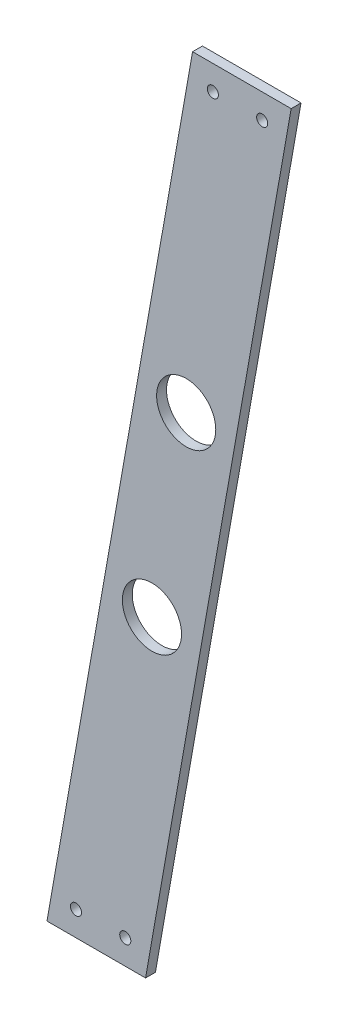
from build123d import *

# Parameters (mm, degrees)
SKETCH1_R           = 12
SKETCH1_R_2         = 2.25
BOSS_EXTRUDE1_DEPTH = 4


with BuildPart() as part:
    # Sketch1 → Boss-Extrude1 (new body)
    with BuildSketch(Plane.XY):
        Polygon((0, 0), (40, 0), (-19.069538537, -335), (-59.069538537, -335), align=None)
        with Locations((-2.588842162, -128.10768988)):
            Circle(SKETCH1_R, mode=Mode.SUBTRACT)
        with Locations((-16.480696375, -206.89231012)):
            Circle(SKETCH1_R, mode=Mode.SUBTRACT)
        with Locations((28.236730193, -10)):
            Circle(SKETCH1_R_2, mode=Mode.SUBTRACT)
        with Locations((8.236730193, -10)):
            Circle(SKETCH1_R_2, mode=Mode.SUBTRACT)
        with Locations((-47.30626873, -325)):
            Circle(SKETCH1_R_2, mode=Mode.SUBTRACT)
        with Locations((-27.30626873, -325)):
            Circle(SKETCH1_R_2, mode=Mode.SUBTRACT)
    extrude(amount=BOSS_EXTRUDE1_DEPTH)


solid = part.part
